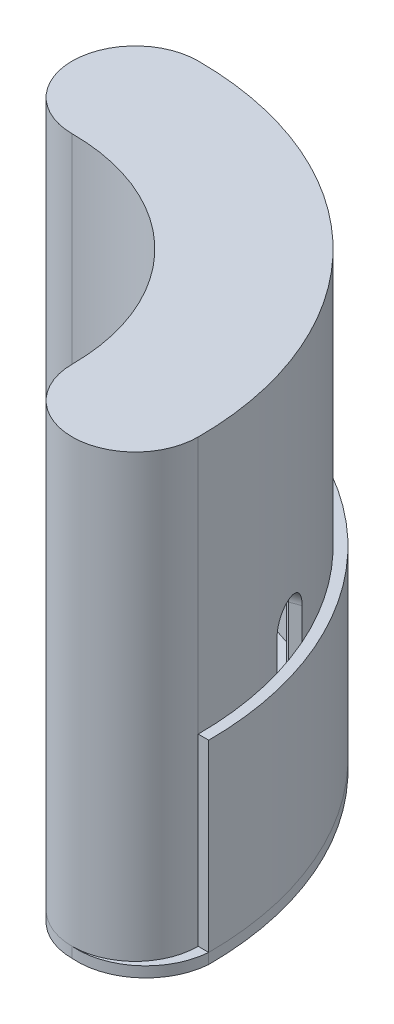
from build123d import *

# Parameters (mm, degrees)
EXTRUDE1_DEPTH      = 104.14
EXTRUDE2_DEPTH      = 2.54
EXTRUDE3_DEPTH      = 52.07
EXTRUDE4_DEPTH      = 52.07
EXTRUDE5_DEPTH      = 9.652
EXTRUDE5_DEPTH_BACK = 7.62
SKETCH6_R           = 5.08
EXTRUDE8_DEPTH      = 7.62
EXTRUDE8_DEPTH_BACK = 7.62
SKETCH9_R           = 5.08
EXTRUDE6_DEPTH      = 2.54
EXTRUDE7_DEPTH      = 44.45


with BuildPart() as part:
    # Sketch1 → Extrude1 (new body)
    with BuildSketch(Plane(origin=(0, 0, 0), x_dir=(1, 0, 0), z_dir=(0, 1, 0))):
        with BuildLine():
            ThreePointArc((0, 78.74), (55.677587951, 55.677587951), (78.74, 0))
            ThreePointArc((78.74, 0), (63.5, -15.24), (48.26, 0))
            ThreePointArc((48.26, 0), (34.12497326, 34.12497326), (0, 48.26))
            ThreePointArc((0, 48.26), (-15.24, 63.5), (0, 78.74))
        make_face()
        with BuildLine():
            ThreePointArc((0, 76.2), (53.881536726, 53.881536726), (76.2, 0))
            ThreePointArc((76.2, 0), (63.5, -12.7), (50.8, 0))
            ThreePointArc((50.8, 0), (35.921024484, 35.921024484), (0, 50.8))
            ThreePointArc((0, 50.8), (-12.7, 63.5), (0, 76.2))
        make_face(mode=Mode.SUBTRACT)
    extrude(amount=EXTRUDE1_DEPTH)

    # Sketch2 → Extrude2 (add)
    with BuildSketch(Plane(origin=(0, 104.14, 0), x_dir=(1, 0, 0), z_dir=(0, 1, 0))):
        with BuildLine():
            ThreePointArc((48.26, 0), (63.5, -15.24), (78.74, 0))
            ThreePointArc((78.74, 0), (55.677587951, 55.677587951), (0, 78.74))
            ThreePointArc((0, 78.74), (-15.24, 63.5), (0, 48.26))
            ThreePointArc((0, 48.26), (34.12497326, 34.12497326), (48.26, 0))
        make_face()
    extrude(amount=EXTRUDE2_DEPTH)

    # Sketch3 → Extrude3 (cut)
    with BuildSketch(Plane(origin=(0, 0, 0), x_dir=(1, 0, 0), z_dir=(0, 1, 0))):
        with BuildLine():
            Line((20.57576867, 73.369460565), (21.42497326, 75.769110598))
            ThreePointArc((21.42497326, 75.769110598), (26.906042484, 76.030071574), (31.002908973, 72.379605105))
            Line((31.002908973, 72.379605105), (30.153704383, 69.979955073))
            ThreePointArc((30.153704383, 69.979955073), (24.672635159, 69.718994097), (20.57576867, 73.369460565))
        make_face()
    extrude(amount=EXTRUDE3_DEPTH, mode=Mode.SUBTRACT)

    # Sketch5 → Extrude4 (cut)
    with BuildSketch(Plane.XZ):
        with BuildLine():
            Line((69.625674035, -30.962970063), (72.015317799, -31.839937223))
            ThreePointArc((72.015317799, -31.839937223), (75.413104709, -27.67559637), (75.515634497, -22.30194042))
            Line((75.515634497, -22.30194042), (73.125990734, -21.42497326))
            ThreePointArc((73.125990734, -21.42497326), (69.728203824, -25.589314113), (69.625674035, -30.962970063))
        make_face()
    extrude(amount=-EXTRUDE4_DEPTH, mode=Mode.SUBTRACT)

    # Sketch6 → Extrude5 (cut, two sides: drawn at the far end of the back side and taken through both)
    with BuildSketch(Plane(origin=(73.765476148, 0, -27.070938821), x_dir=(-0.34451936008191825, 0, -0.9387792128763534), z_dir=(0.9387792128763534, 0, -0.34451936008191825)).offset(-EXTRUDE5_DEPTH_BACK)):
        with Locations((0, 52.07)):
            Circle(SKETCH6_R)
    extrude(amount=EXTRUDE5_DEPTH + EXTRUDE5_DEPTH_BACK, mode=Mode.SUBTRACT)

    # Sketch9 → Extrude8 (cut, two sides: drawn at the far end of the back side and taken through both)
    with BuildSketch(Plane(origin=(26.213941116, 0, -74.074357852), x_dir=(-0.9427102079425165, 0, -0.333612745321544), z_dir=(0.333612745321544, 0, -0.9427102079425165)).offset(-EXTRUDE8_DEPTH_BACK)):
        with Locations((0, 52.07)):
            Circle(SKETCH9_R)
    extrude(amount=EXTRUDE8_DEPTH + EXTRUDE8_DEPTH_BACK, mode=Mode.SUBTRACT)


with BuildPart() as body_2:
    # Sketch7 → Extrude6 (new body)
    with BuildSketch(Plane.XZ):
        with BuildLine():
            ThreePointArc((0, -48.26), (34.12497326, -34.12497326), (48.26, 0))
            ThreePointArc((48.26, 0), (52.723692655, 10.776307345), (63.5, 15.24))
            ThreePointArc((63.5, 15.24), (75.546307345, 11.302358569), (81.28, 0))
            ThreePointArc((81.28, 0), (57.473639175, -57.473639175), (0, -81.28))
            ThreePointArc((0, -81.28), (-11.302358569, -75.546307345), (-15.24, -63.5))
            ThreePointArc((-15.24, -63.5), (-10.776307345, -52.723692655), (0, -48.26))
        make_face()
    extrude(amount=EXTRUDE6_DEPTH)


with BuildPart() as body_3:
    # Sketch8 → Extrude7 (new body)
    with BuildSketch(Plane(origin=(0, 0, 0), x_dir=(1, 0, 0), z_dir=(0, 1, 0))):
        with BuildLine():
            Line((0, 81.28), (0, 78.74))
            ThreePointArc((0, 78.74), (55.677587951, 55.677587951), (78.74, 0))
            Line((78.74, 0), (81.28, 0))
            ThreePointArc((81.28, 0), (57.473639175, 57.473639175), (0, 81.28))
        make_face()
    extrude(amount=EXTRUDE7_DEPTH)


solid = Compound([part.part, body_2.part, body_3.part])
